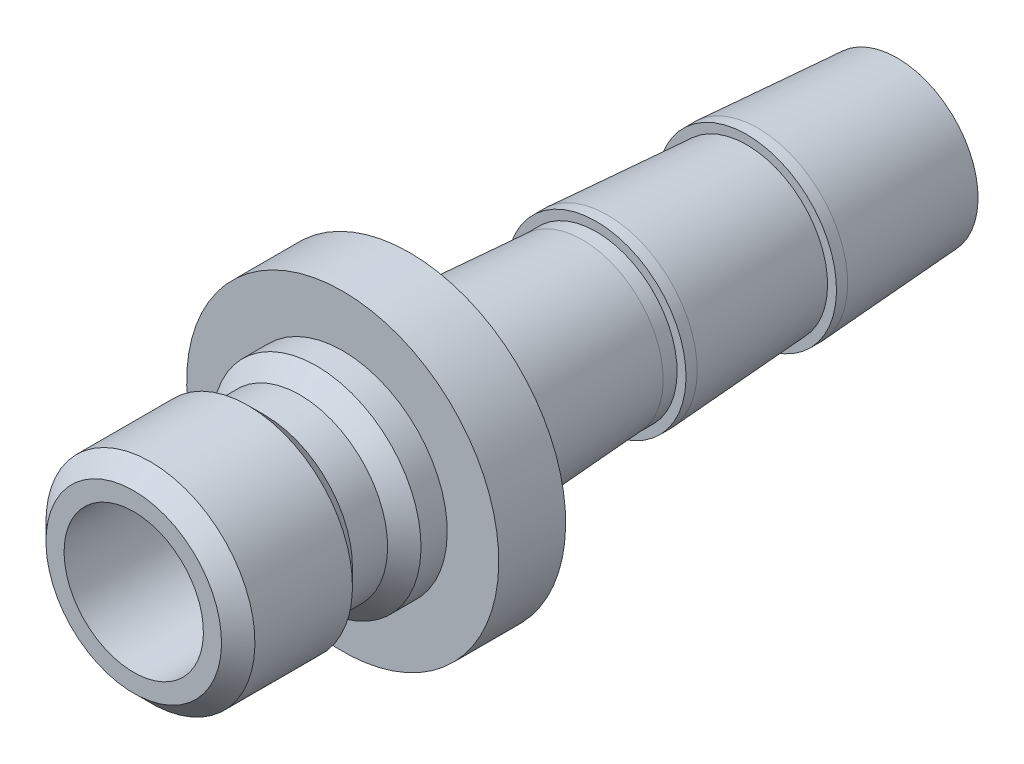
from build123d import *


with BuildPart() as part:
    # Sketch1 → Revolve1 (revolve)
    with BuildSketch(Plane(origin=(0, 0, 0), x_dir=(0, 0, -1), z_dir=(1, 0, 0))):
        Polygon((-9.525, 3.175), (-9.525, 4.0005), (-8.763, 4.7625), (-4.318, 4.7625), (-3.556, 4.0005), (-1.9558, 4.0005), (-1.1938, 4.7625), (0, 4.7625), (0, 7.112), (3.048, 7.112), (3.048, 4.0894), (4.572, 4.0894), (10.922, 3.683), (11.557, 3.683), (11.557, 4.0894), (12.065, 4.0894), (18.415, 3.683), (18.415, 4.0894), (18.923, 4.0894), (25.273, 3.683), (25.273, 3.175), align=None)
    revolve(axis=Axis((0, 0, 0), (0, 0, 1)))


solid = part.part
